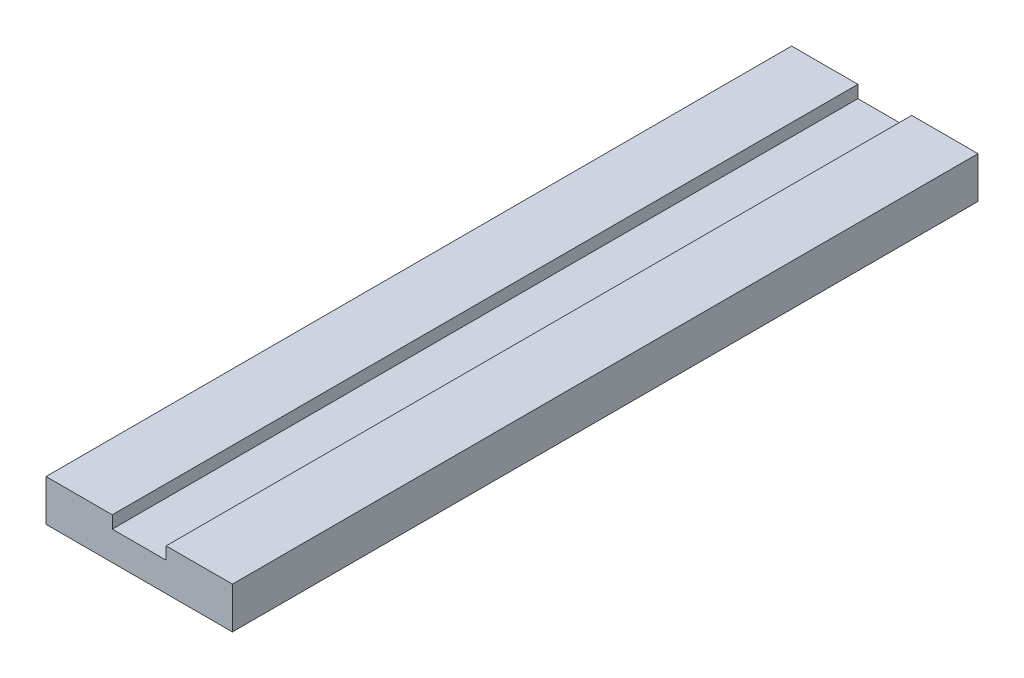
ISO-10303-21;
HEADER;
FILE_DESCRIPTION(('STEP AP214'),'2;1');
FILE_NAME('part.step','',(''),(''),'','','');
FILE_SCHEMA(('AUTOMOTIVE_DESIGN { 1 0 10303 214 1 1 1 1 }'));
ENDSEC;
DATA;
#1=APPLICATION_CONTEXT('core data for automotive mechanical design processes');
#2=APPLICATION_PROTOCOL_DEFINITION('international standard','automotive_design',2000,#1);
#3=PRODUCT_CONTEXT('',#1,'mechanical');
#4=PRODUCT('Part','Part','',(#3));
#5=PRODUCT_RELATED_PRODUCT_CATEGORY('part','',(#4));
#6=PRODUCT_DEFINITION_FORMATION('','',#4);
#7=PRODUCT_DEFINITION_CONTEXT('part definition',#1,'design');
#8=PRODUCT_DEFINITION('design','',#6,#7);
#9=PRODUCT_DEFINITION_SHAPE('','',#8);
#10=(LENGTH_UNIT() NAMED_UNIT(*) SI_UNIT(.MILLI.,.METRE.));
#11=(NAMED_UNIT(*) PLANE_ANGLE_UNIT() SI_UNIT($,.RADIAN.));
#12=(NAMED_UNIT(*) SI_UNIT($,.STERADIAN.) SOLID_ANGLE_UNIT());
#13=UNCERTAINTY_MEASURE_WITH_UNIT(LENGTH_MEASURE(1.E-05),#10,'distance_accuracy_value','');
#14=(GEOMETRIC_REPRESENTATION_CONTEXT(3) GLOBAL_UNCERTAINTY_ASSIGNED_CONTEXT((#13)) GLOBAL_UNIT_ASSIGNED_CONTEXT((#10,
#11,#12)) REPRESENTATION_CONTEXT('',''));
#15=CARTESIAN_POINT('',(0.,0.,0.));
#16=DIRECTION('',(0.,0.,1.));
#17=DIRECTION('',(1.,0.,0.));
#18=AXIS2_PLACEMENT_3D('',#15,#16,#17);
#19=CARTESIAN_POINT('',(0.,10.,0.));
#20=DIRECTION('',(0.,1.,0.));
#21=DIRECTION('',(0.,0.,1.));
#22=AXIS2_PLACEMENT_3D('',#19,#20,#21);
#23=PLANE('',#22);
#24=DIRECTION('',(0.,0.,-1.));
#25=VECTOR('',#24,1.);
#26=CARTESIAN_POINT('',(-22.5,10.,-90.));
#27=LINE('',#26,#25);
#28=CARTESIAN_POINT('',(-22.5,10.,-90.));
#29=VERTEX_POINT('',#28);
#30=CARTESIAN_POINT('',(-22.5,10.,90.));
#31=VERTEX_POINT('',#30);
#32=EDGE_CURVE('E129',#29,#31,#27,.F.);
#33=ORIENTED_EDGE('',*,*,#32,.T.);
#34=DIRECTION('',(-1.,0.,0.));
#35=VECTOR('',#34,1.);
#36=CARTESIAN_POINT('',(-22.5,10.,90.));
#37=LINE('',#36,#35);
#38=CARTESIAN_POINT('',(-6.5,10.,90.));
#39=VERTEX_POINT('',#38);
#40=EDGE_CURVE('E88',#31,#39,#37,.F.);
#41=ORIENTED_EDGE('',*,*,#40,.T.);
#42=DIRECTION('',(0.,0.,1.));
#43=VECTOR('',#42,1.);
#44=CARTESIAN_POINT('',(-6.5,10.,-90.));
#45=LINE('',#44,#43);
#46=CARTESIAN_POINT('',(-6.5,10.,-90.));
#47=VERTEX_POINT('',#46);
#48=EDGE_CURVE('E20',#39,#47,#45,.F.);
#49=ORIENTED_EDGE('',*,*,#48,.T.);
#50=DIRECTION('',(1.,0.,0.));
#51=VECTOR('',#50,1.);
#52=CARTESIAN_POINT('',(-22.5,10.,-90.));
#53=LINE('',#52,#51);
#54=EDGE_CURVE('E85',#47,#29,#53,.F.);
#55=ORIENTED_EDGE('',*,*,#54,.T.);
#56=EDGE_LOOP('',(#33,#41,#49,#55));
#57=FACE_BOUND('',#56,.T.);
#58=ADVANCED_FACE('F17',(#57),#23,.T.);
#59=CARTESIAN_POINT('',(-6.5,7.,-90.));
#60=DIRECTION('',(-1.,0.,0.));
#61=DIRECTION('',(0.,0.,1.));
#62=AXIS2_PLACEMENT_3D('',#59,#60,#61);
#63=PLANE('',#62);
#64=DIRECTION('',(0.,1.,0.));
#65=VECTOR('',#64,1.);
#66=CARTESIAN_POINT('',(-6.5,10.,90.));
#67=LINE('',#66,#65);
#68=CARTESIAN_POINT('',(-6.5,7.,90.));
#69=VERTEX_POINT('',#68);
#70=EDGE_CURVE('E117',#39,#69,#67,.F.);
#71=ORIENTED_EDGE('',*,*,#70,.T.);
#72=DIRECTION('',(0.,0.,1.));
#73=VECTOR('',#72,1.);
#74=CARTESIAN_POINT('',(-6.5,7.,0.));
#75=LINE('',#74,#73);
#76=CARTESIAN_POINT('',(-6.5,7.,-90.));
#77=VERTEX_POINT('',#76);
#78=EDGE_CURVE('E92',#77,#69,#75,.T.);
#79=ORIENTED_EDGE('',*,*,#78,.F.);
#80=DIRECTION('',(0.,1.,0.));
#81=VECTOR('',#80,1.);
#82=CARTESIAN_POINT('',(-6.5,10.,-90.));
#83=LINE('',#82,#81);
#84=EDGE_CURVE('E80',#77,#47,#83,.T.);
#85=ORIENTED_EDGE('',*,*,#84,.T.);
#86=ORIENTED_EDGE('',*,*,#48,.F.);
#87=EDGE_LOOP('',(#71,#79,#85,#86));
#88=FACE_BOUND('',#87,.T.);
#89=ADVANCED_FACE('F100',(#88),#63,.F.);
#90=CARTESIAN_POINT('',(0.,7.,0.));
#91=DIRECTION('',(0.,1.,0.));
#92=DIRECTION('',(0.,0.,1.));
#93=AXIS2_PLACEMENT_3D('',#90,#91,#92);
#94=PLANE('',#93);
#95=ORIENTED_EDGE('',*,*,#78,.T.);
#96=DIRECTION('',(-1.,0.,0.));
#97=VECTOR('',#96,1.);
#98=CARTESIAN_POINT('',(-22.5,7.,90.));
#99=LINE('',#98,#97);
#100=CARTESIAN_POINT('',(6.5,7.,90.));
#101=VERTEX_POINT('',#100);
#102=EDGE_CURVE('E112',#69,#101,#99,.F.);
#103=ORIENTED_EDGE('',*,*,#102,.T.);
#104=DIRECTION('',(0.,0.,-1.));
#105=VECTOR('',#104,1.);
#106=CARTESIAN_POINT('',(6.5,7.,-90.));
#107=LINE('',#106,#105);
#108=CARTESIAN_POINT('',(6.5,7.,-90.));
#109=VERTEX_POINT('',#108);
#110=EDGE_CURVE('E104',#101,#109,#107,.T.);
#111=ORIENTED_EDGE('',*,*,#110,.T.);
#112=DIRECTION('',(1.,0.,0.));
#113=VECTOR('',#112,1.);
#114=CARTESIAN_POINT('',(-22.5,7.,-90.));
#115=LINE('',#114,#113);
#116=EDGE_CURVE('E113',#109,#77,#115,.F.);
#117=ORIENTED_EDGE('',*,*,#116,.T.);
#118=EDGE_LOOP('',(#95,#103,#111,#117));
#119=FACE_BOUND('',#118,.T.);
#120=ADVANCED_FACE('F111',(#119),#94,.T.);
#121=CARTESIAN_POINT('',(6.5,7.,-90.));
#122=DIRECTION('',(1.,0.,0.));
#123=DIRECTION('',(0.,0.,-1.));
#124=AXIS2_PLACEMENT_3D('',#121,#122,#123);
#125=PLANE('',#124);
#126=DIRECTION('',(0.,1.,0.));
#127=VECTOR('',#126,1.);
#128=CARTESIAN_POINT('',(6.5,10.,-90.));
#129=LINE('',#128,#127);
#130=CARTESIAN_POINT('',(6.5,10.,-90.));
#131=VERTEX_POINT('',#130);
#132=EDGE_CURVE('E133',#131,#109,#129,.F.);
#133=ORIENTED_EDGE('',*,*,#132,.T.);
#134=ORIENTED_EDGE('',*,*,#110,.F.);
#135=DIRECTION('',(0.,1.,0.));
#136=VECTOR('',#135,1.);
#137=CARTESIAN_POINT('',(6.5,10.,90.));
#138=LINE('',#137,#136);
#139=CARTESIAN_POINT('',(6.5,10.,90.));
#140=VERTEX_POINT('',#139);
#141=EDGE_CURVE('E120',#101,#140,#138,.T.);
#142=ORIENTED_EDGE('',*,*,#141,.T.);
#143=DIRECTION('',(0.,0.,1.));
#144=VECTOR('',#143,1.);
#145=CARTESIAN_POINT('',(6.5,10.,0.));
#146=LINE('',#145,#144);
#147=EDGE_CURVE('E102',#131,#140,#146,.T.);
#148=ORIENTED_EDGE('',*,*,#147,.F.);
#149=EDGE_LOOP('',(#133,#134,#142,#148));
#150=FACE_BOUND('',#149,.T.);
#151=ADVANCED_FACE('F154',(#150),#125,.F.);
#152=CARTESIAN_POINT('',(0.,10.,0.));
#153=DIRECTION('',(0.,1.,0.));
#154=DIRECTION('',(0.,0.,1.));
#155=AXIS2_PLACEMENT_3D('',#152,#153,#154);
#156=PLANE('',#155);
#157=DIRECTION('',(0.,0.,1.));
#158=VECTOR('',#157,1.);
#159=CARTESIAN_POINT('',(22.5,10.,-90.));
#160=LINE('',#159,#158);
#161=CARTESIAN_POINT('',(22.5,10.,90.));
#162=VERTEX_POINT('',#161);
#163=CARTESIAN_POINT('',(22.5,10.,-90.));
#164=VERTEX_POINT('',#163);
#165=EDGE_CURVE('E139',#162,#164,#160,.F.);
#166=ORIENTED_EDGE('',*,*,#165,.T.);
#167=DIRECTION('',(1.,0.,0.));
#168=VECTOR('',#167,1.);
#169=CARTESIAN_POINT('',(-22.5,10.,-90.));
#170=LINE('',#169,#168);
#171=EDGE_CURVE('E98',#164,#131,#170,.F.);
#172=ORIENTED_EDGE('',*,*,#171,.T.);
#173=ORIENTED_EDGE('',*,*,#147,.T.);
#174=DIRECTION('',(-1.,0.,0.));
#175=VECTOR('',#174,1.);
#176=CARTESIAN_POINT('',(-22.5,10.,90.));
#177=LINE('',#176,#175);
#178=EDGE_CURVE('E152',#140,#162,#177,.F.);
#179=ORIENTED_EDGE('',*,*,#178,.T.);
#180=EDGE_LOOP('',(#166,#172,#173,#179));
#181=FACE_BOUND('',#180,.T.);
#182=ADVANCED_FACE('F138',(#181),#156,.T.);
#183=CARTESIAN_POINT('',(-22.5,10.,-90.));
#184=DIRECTION('',(0.,0.,1.));
#185=DIRECTION('',(1.,0.,0.));
#186=AXIS2_PLACEMENT_3D('',#183,#184,#185);
#187=PLANE('',#186);
#188=ORIENTED_EDGE('',*,*,#132,.F.);
#189=ORIENTED_EDGE('',*,*,#171,.F.);
#190=DIRECTION('',(0.,1.,0.));
#191=VECTOR('',#190,1.);
#192=CARTESIAN_POINT('',(22.5,10.,-90.));
#193=LINE('',#192,#191);
#194=CARTESIAN_POINT('',(22.5,0.,-90.));
#195=VERTEX_POINT('',#194);
#196=EDGE_CURVE('E142',#164,#195,#193,.F.);
#197=ORIENTED_EDGE('',*,*,#196,.T.);
#198=DIRECTION('',(1.,0.,0.));
#199=VECTOR('',#198,1.);
#200=CARTESIAN_POINT('',(0.,0.,-90.));
#201=LINE('',#200,#199);
#202=CARTESIAN_POINT('',(-22.5,0.,-90.));
#203=VERTEX_POINT('',#202);
#204=EDGE_CURVE('E144',#195,#203,#201,.F.);
#205=ORIENTED_EDGE('',*,*,#204,.T.);
#206=DIRECTION('',(0.,1.,0.));
#207=VECTOR('',#206,1.);
#208=CARTESIAN_POINT('',(-22.5,10.,-90.));
#209=LINE('',#208,#207);
#210=EDGE_CURVE('E97',#203,#29,#209,.T.);
#211=ORIENTED_EDGE('',*,*,#210,.T.);
#212=ORIENTED_EDGE('',*,*,#54,.F.);
#213=ORIENTED_EDGE('',*,*,#84,.F.);
#214=ORIENTED_EDGE('',*,*,#116,.F.);
#215=EDGE_LOOP('',(#188,#189,#197,#205,#211,#212,#213,#214));
#216=FACE_BOUND('',#215,.T.);
#217=ADVANCED_FACE('F95',(#216),#187,.F.);
#218=CARTESIAN_POINT('',(-22.5,10.,-90.));
#219=DIRECTION('',(1.,0.,0.));
#220=DIRECTION('',(0.,0.,-1.));
#221=AXIS2_PLACEMENT_3D('',#218,#219,#220);
#222=PLANE('',#221);
#223=DIRECTION('',(0.,1.,0.));
#224=VECTOR('',#223,1.);
#225=CARTESIAN_POINT('',(-22.5,10.,90.));
#226=LINE('',#225,#224);
#227=CARTESIAN_POINT('',(-22.5,0.,90.));
#228=VERTEX_POINT('',#227);
#229=EDGE_CURVE('E123',#228,#31,#226,.T.);
#230=ORIENTED_EDGE('',*,*,#229,.T.);
#231=ORIENTED_EDGE('',*,*,#32,.F.);
#232=ORIENTED_EDGE('',*,*,#210,.F.);
#233=DIRECTION('',(0.,0.,1.));
#234=VECTOR('',#233,1.);
#235=CARTESIAN_POINT('',(-22.5,0.,0.));
#236=LINE('',#235,#234);
#237=EDGE_CURVE('E146',#203,#228,#236,.T.);
#238=ORIENTED_EDGE('',*,*,#237,.T.);
#239=EDGE_LOOP('',(#230,#231,#232,#238));
#240=FACE_BOUND('',#239,.T.);
#241=ADVANCED_FACE('F176',(#240),#222,.F.);
#242=CARTESIAN_POINT('',(-22.5,10.,90.));
#243=DIRECTION('',(0.,0.,-1.));
#244=DIRECTION('',(-1.,0.,0.));
#245=AXIS2_PLACEMENT_3D('',#242,#243,#244);
#246=PLANE('',#245);
#247=ORIENTED_EDGE('',*,*,#141,.F.);
#248=ORIENTED_EDGE('',*,*,#102,.F.);
#249=ORIENTED_EDGE('',*,*,#70,.F.);
#250=ORIENTED_EDGE('',*,*,#40,.F.);
#251=ORIENTED_EDGE('',*,*,#229,.F.);
#252=DIRECTION('',(1.,0.,0.));
#253=VECTOR('',#252,1.);
#254=CARTESIAN_POINT('',(0.,0.,90.));
#255=LINE('',#254,#253);
#256=CARTESIAN_POINT('',(22.5,0.,90.));
#257=VERTEX_POINT('',#256);
#258=EDGE_CURVE('E26',#228,#257,#255,.T.);
#259=ORIENTED_EDGE('',*,*,#258,.T.);
#260=DIRECTION('',(0.,1.,0.));
#261=VECTOR('',#260,1.);
#262=CARTESIAN_POINT('',(22.5,10.,90.));
#263=LINE('',#262,#261);
#264=EDGE_CURVE('E34',#257,#162,#263,.T.);
#265=ORIENTED_EDGE('',*,*,#264,.T.);
#266=ORIENTED_EDGE('',*,*,#178,.F.);
#267=EDGE_LOOP('',(#247,#248,#249,#250,#251,#259,#265,#266));
#268=FACE_BOUND('',#267,.T.);
#269=ADVANCED_FACE('F116',(#268),#246,.F.);
#270=CARTESIAN_POINT('',(22.5,10.,-90.));
#271=DIRECTION('',(-1.,0.,0.));
#272=DIRECTION('',(0.,0.,1.));
#273=AXIS2_PLACEMENT_3D('',#270,#271,#272);
#274=PLANE('',#273);
#275=ORIENTED_EDGE('',*,*,#196,.F.);
#276=ORIENTED_EDGE('',*,*,#165,.F.);
#277=ORIENTED_EDGE('',*,*,#264,.F.);
#278=DIRECTION('',(0.,0.,1.));
#279=VECTOR('',#278,1.);
#280=CARTESIAN_POINT('',(22.5,0.,0.));
#281=LINE('',#280,#279);
#282=EDGE_CURVE('E11',#257,#195,#281,.F.);
#283=ORIENTED_EDGE('',*,*,#282,.T.);
#284=EDGE_LOOP('',(#275,#276,#277,#283));
#285=FACE_BOUND('',#284,.T.);
#286=ADVANCED_FACE('F143',(#285),#274,.F.);
#287=CARTESIAN_POINT('',(0.,0.,0.));
#288=DIRECTION('',(0.,1.,0.));
#289=DIRECTION('',(0.,0.,1.));
#290=AXIS2_PLACEMENT_3D('',#287,#288,#289);
#291=PLANE('',#290);
#292=ORIENTED_EDGE('',*,*,#258,.F.);
#293=ORIENTED_EDGE('',*,*,#237,.F.);
#294=ORIENTED_EDGE('',*,*,#204,.F.);
#295=ORIENTED_EDGE('',*,*,#282,.F.);
#296=EDGE_LOOP('',(#292,#293,#294,#295));
#297=FACE_BOUND('',#296,.T.);
#298=ADVANCED_FACE('F164',(#297),#291,.F.);
#299=CLOSED_SHELL('',(#58,#89,#120,#151,#182,#217,#241,#269,#286,#298));
#300=MANIFOLD_SOLID_BREP('B1',#299);
#301=ADVANCED_BREP_SHAPE_REPRESENTATION('',(#18,#300),#14);
#302=SHAPE_DEFINITION_REPRESENTATION(#9,#301);
ENDSEC;
END-ISO-10303-21;
